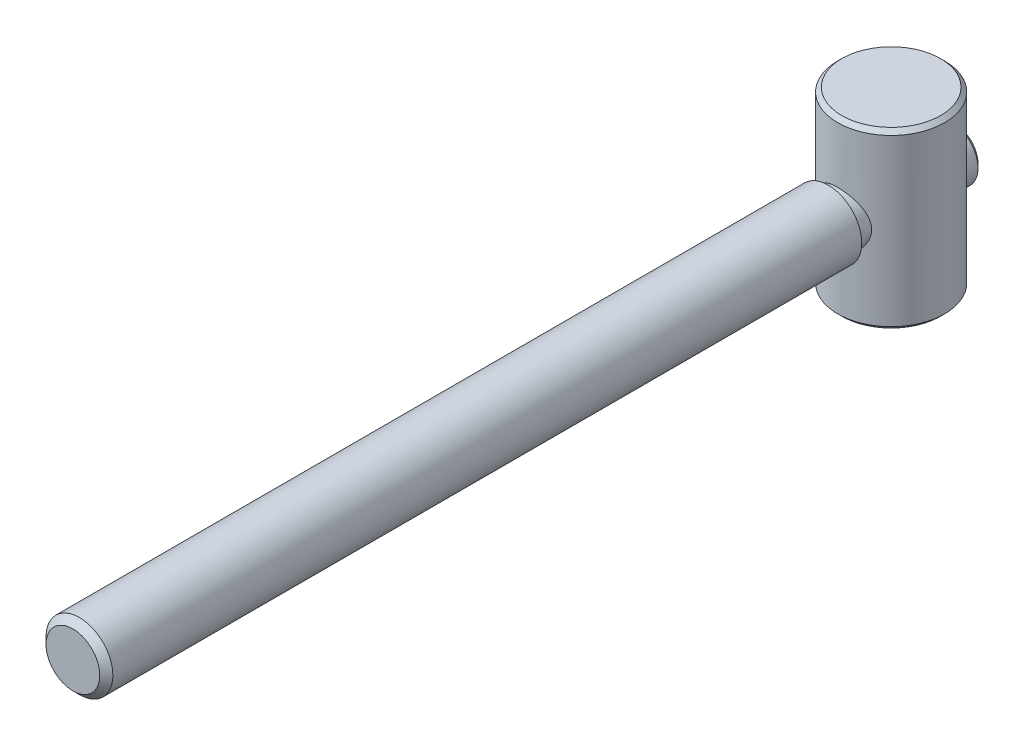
ISO-10303-21;
HEADER;
FILE_DESCRIPTION(('STEP AP214'),'2;1');
FILE_NAME('part.step','',(''),(''),'','','');
FILE_SCHEMA(('AUTOMOTIVE_DESIGN { 1 0 10303 214 1 1 1 1 }'));
ENDSEC;
DATA;
#1=APPLICATION_CONTEXT('core data for automotive mechanical design processes');
#2=APPLICATION_PROTOCOL_DEFINITION('international standard','automotive_design',2000,#1);
#3=PRODUCT_CONTEXT('',#1,'mechanical');
#4=PRODUCT('Part','Part','',(#3));
#5=PRODUCT_RELATED_PRODUCT_CATEGORY('part','',(#4));
#6=PRODUCT_DEFINITION_FORMATION('','',#4);
#7=PRODUCT_DEFINITION_CONTEXT('part definition',#1,'design');
#8=PRODUCT_DEFINITION('design','',#6,#7);
#9=PRODUCT_DEFINITION_SHAPE('','',#8);
#10=(LENGTH_UNIT() NAMED_UNIT(*) SI_UNIT(.MILLI.,.METRE.));
#11=(NAMED_UNIT(*) PLANE_ANGLE_UNIT() SI_UNIT($,.RADIAN.));
#12=(NAMED_UNIT(*) SI_UNIT($,.STERADIAN.) SOLID_ANGLE_UNIT());
#13=UNCERTAINTY_MEASURE_WITH_UNIT(LENGTH_MEASURE(1.E-05),#10,'distance_accuracy_value','');
#14=(GEOMETRIC_REPRESENTATION_CONTEXT(3) GLOBAL_UNCERTAINTY_ASSIGNED_CONTEXT((#13)) GLOBAL_UNIT_ASSIGNED_CONTEXT((#10,
#11,#12)) REPRESENTATION_CONTEXT('',''));
#15=CARTESIAN_POINT('',(0.,0.,0.));
#16=DIRECTION('',(0.,0.,1.));
#17=DIRECTION('',(1.,0.,0.));
#18=AXIS2_PLACEMENT_3D('',#15,#16,#17);
#19=CARTESIAN_POINT('',(-0.4,0.,-46.2));
#20=DIRECTION('',(1.,0.,0.));
#21=DIRECTION('',(0.,-1.,0.));
#22=AXIS2_PLACEMENT_3D('',#19,#20,#21);
#23=CYLINDRICAL_SURFACE('',#22,31.5);
#24=CARTESIAN_POINT('',(-0.4,0.,-46.2));
#25=DIRECTION('',(-1.,0.,0.));
#26=DIRECTION('',(0.,1.,0.));
#27=AXIS2_PLACEMENT_3D('',#24,#25,#26);
#28=CIRCLE('',#27,31.5);
#29=CARTESIAN_POINT('',(-0.4,-1.95959179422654,-14.7610114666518));
#30=VERTEX_POINT('',#29);
#31=CARTESIAN_POINT('',(-0.4,1.95959179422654,-14.7610114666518));
#32=VERTEX_POINT('',#31);
#33=EDGE_CURVE('E118',#30,#32,#28,.T.);
#34=ORIENTED_EDGE('',*,*,#33,.T.);
#35=CARTESIAN_POINT('',(-0.4,1.95959179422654,-14.7610114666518));
#36=CARTESIAN_POINT('',(-0.344561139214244,1.97091486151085,-14.7617184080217));
#37=CARTESIAN_POINT('',(-0.28863792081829,1.97987306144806,-14.762281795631));
#38=CARTESIAN_POINT('',(-0.176213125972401,1.99302430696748,-14.7631121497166));
#39=CARTESIAN_POINT('',(-0.119711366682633,1.99721579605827,-14.7633790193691));
#40=CARTESIAN_POINT('',(-0.00749894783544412,2.0007609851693,-14.7636046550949));
#41=CARTESIAN_POINT('',(0.0482092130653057,2.00019410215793,-14.7635684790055));
#42=CARTESIAN_POINT('',(0.159360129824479,1.99441663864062,-14.7632012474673));
#43=CARTESIAN_POINT('',(0.214802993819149,1.98920814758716,-14.7628703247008));
#44=CARTESIAN_POINT('',(0.313516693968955,1.97576492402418,-14.762023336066));
#45=CARTESIAN_POINT('',(0.356906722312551,1.96839158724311,-14.761560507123));
#46=CARTESIAN_POINT('',(0.4,1.95959179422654,-14.7610114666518));
#47=B_SPLINE_CURVE_WITH_KNOTS('',3,(#35,#36,#37,#38,#39,#40,#41,#42,#43,#44,#45,#46),
.UNSPECIFIED.,.F.,.F.,(4,2,2,2,2,4),(0.,0.169712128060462,0.33947965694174,0.506419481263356,
0.673284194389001,0.805229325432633),.UNSPECIFIED.);
#48=CARTESIAN_POINT('',(0.4,1.95959179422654,-14.7610114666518));
#49=VERTEX_POINT('',#48);
#50=EDGE_CURVE('E208',#32,#49,#47,.T.);
#51=ORIENTED_EDGE('',*,*,#50,.T.);
#52=CARTESIAN_POINT('',(0.4,0.,-46.2));
#53=DIRECTION('',(-1.,0.,0.));
#54=DIRECTION('',(0.,1.,0.));
#55=AXIS2_PLACEMENT_3D('',#52,#53,#54);
#56=CIRCLE('',#55,31.5);
#57=CARTESIAN_POINT('',(0.4,-1.95959179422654,-14.7610114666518));
#58=VERTEX_POINT('',#57);
#59=EDGE_CURVE('E105',#58,#49,#56,.T.);
#60=ORIENTED_EDGE('',*,*,#59,.F.);
#61=CARTESIAN_POINT('',(0.4,-1.95959179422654,-14.7610114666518));
#62=CARTESIAN_POINT('',(0.344561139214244,-1.97091486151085,-14.7617184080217));
#63=CARTESIAN_POINT('',(0.28863792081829,-1.97987306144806,-14.762281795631));
#64=CARTESIAN_POINT('',(0.176213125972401,-1.99302430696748,-14.7631121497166));
#65=CARTESIAN_POINT('',(0.119711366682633,-1.99721579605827,-14.7633790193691));
#66=CARTESIAN_POINT('',(0.00749894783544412,-2.0007609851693,-14.7636046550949));
#67=CARTESIAN_POINT('',(-0.0482092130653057,-2.00019410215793,-14.7635684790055));
#68=CARTESIAN_POINT('',(-0.159360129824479,-1.99441663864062,-14.7632012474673));
#69=CARTESIAN_POINT('',(-0.214802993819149,-1.98920814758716,-14.7628703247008));
#70=CARTESIAN_POINT('',(-0.313516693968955,-1.97576492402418,-14.762023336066));
#71=CARTESIAN_POINT('',(-0.356906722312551,-1.96839158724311,-14.761560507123));
#72=CARTESIAN_POINT('',(-0.4,-1.95959179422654,-14.7610114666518));
#73=B_SPLINE_CURVE_WITH_KNOTS('',3,(#61,#62,#63,#64,#65,#66,#67,#68,#69,#70,#71,#72),
.UNSPECIFIED.,.F.,.F.,(4,2,2,2,2,4),(0.,0.169712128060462,0.33947965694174,0.506419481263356,
0.673284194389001,0.805229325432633),.UNSPECIFIED.);
#74=EDGE_CURVE('E120',#58,#30,#73,.T.);
#75=ORIENTED_EDGE('',*,*,#74,.T.);
#76=EDGE_LOOP('',(#34,#51,#60,#75));
#77=FACE_BOUND('',#76,.T.);
#78=ADVANCED_FACE('F19',(#77),#23,.F.);
#79=CARTESIAN_POINT('',(0.,0.,-6.7));
#80=DIRECTION('',(0.,0.,1.));
#81=DIRECTION('',(1.,0.,0.));
#82=AXIS2_PLACEMENT_3D('',#79,#80,#81);
#83=CYLINDRICAL_SURFACE('',#82,2.);
#84=DIRECTION('',(0.,0.,1.));
#85=VECTOR('',#84,1.);
#86=CARTESIAN_POINT('',(0.4,-1.95959179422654,-16.2));
#87=LINE('',#86,#85);
#88=CARTESIAN_POINT('',(0.4,-1.95959179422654,-15.8935));
#89=VERTEX_POINT('',#88);
#90=CARTESIAN_POINT('',(0.4,-1.95959179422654,-15.3799497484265));
#91=VERTEX_POINT('',#90);
#92=EDGE_CURVE('E315',#89,#91,#87,.T.);
#93=ORIENTED_EDGE('',*,*,#92,.F.);
#94=CARTESIAN_POINT('',(0.,0.,-15.8935));
#95=DIRECTION('',(0.,0.,1.));
#96=DIRECTION('',(1.,0.,0.));
#97=AXIS2_PLACEMENT_3D('',#94,#95,#96);
#98=CIRCLE('',#97,2.);
#99=CARTESIAN_POINT('',(0.4,1.95959179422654,-15.8935));
#100=VERTEX_POINT('',#99);
#101=EDGE_CURVE('E589',#89,#100,#98,.T.);
#102=ORIENTED_EDGE('',*,*,#101,.T.);
#103=DIRECTION('',(0.,0.,1.));
#104=VECTOR('',#103,1.);
#105=CARTESIAN_POINT('',(0.4,1.95959179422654,-16.2));
#106=LINE('',#105,#104);
#107=CARTESIAN_POINT('',(0.4,1.95959179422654,-15.3799497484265));
#108=VERTEX_POINT('',#107);
#109=EDGE_CURVE('E313',#100,#108,#106,.T.);
#110=ORIENTED_EDGE('',*,*,#109,.T.);
#111=CARTESIAN_POINT('',(2.,0.,-14.8641016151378));
#112=CARTESIAN_POINT('',(1.99999158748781,0.104213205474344,-14.8641118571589));
#113=CARTESIAN_POINT('',(1.99179963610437,0.208562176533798,-14.8688763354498));
#114=CARTESIAN_POINT('',(1.95944672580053,0.414055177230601,-14.8872470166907));
#115=CARTESIAN_POINT('',(1.93525221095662,0.515192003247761,-14.9008717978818));
#116=CARTESIAN_POINT('',(1.8721998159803,0.710903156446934,-14.9349870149));
#117=CARTESIAN_POINT('',(1.83341988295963,0.80550925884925,-14.9554408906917));
#118=CARTESIAN_POINT('',(1.74253507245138,0.986848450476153,-15.0008532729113));
#119=CARTESIAN_POINT('',(1.69042947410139,1.07358111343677,-15.0258120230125));
#120=CARTESIAN_POINT('',(1.569333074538,1.24461144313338,-15.0799373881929));
#121=CARTESIAN_POINT('',(1.49930407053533,1.32811826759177,-15.109281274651));
#122=CARTESIAN_POINT('',(1.34650761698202,1.4828167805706,-15.1674396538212));
#123=CARTESIAN_POINT('',(1.26373385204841,1.55400232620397,-15.1962538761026));
#124=CARTESIAN_POINT('',(1.08097912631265,1.6867343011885,-15.2524295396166));
#125=CARTESIAN_POINT('',(0.980214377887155,1.74730753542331,-15.2795621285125));
#126=CARTESIAN_POINT('',(0.768314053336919,1.85028170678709,-15.3270151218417));
#127=CARTESIAN_POINT('',(0.657185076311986,1.8926941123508,-15.3473398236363));
#128=CARTESIAN_POINT('',(0.436089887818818,1.95500932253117,-15.3776092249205));
#129=CARTESIAN_POINT('',(0.326603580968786,1.9762990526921,-15.3881896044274));
#130=CARTESIAN_POINT('',(0.105141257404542,2.00033223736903,-15.4001516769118));
#131=CARTESIAN_POINT('',(-0.00683321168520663,2.00308691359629,-15.4015389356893));
#132=CARTESIAN_POINT('',(-0.219665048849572,1.99050665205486,-15.3952596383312));
#133=CARTESIAN_POINT('',(-0.320642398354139,1.97672396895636,-15.3883699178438));
#134=CARTESIAN_POINT('',(-0.518627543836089,1.93423831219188,-15.3674849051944));
#135=CARTESIAN_POINT('',(-0.615635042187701,1.90553422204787,-15.3534890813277));
#136=CARTESIAN_POINT('',(-0.804618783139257,1.83383486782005,-15.3194316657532));
#137=CARTESIAN_POINT('',(-0.896506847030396,1.79064737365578,-15.299288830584));
#138=CARTESIAN_POINT('',(-1.07195360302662,1.6914731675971,-15.2547529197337));
#139=CARTESIAN_POINT('',(-1.15550929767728,1.63548187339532,-15.2303583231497));
#140=CARTESIAN_POINT('',(-1.3203473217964,1.50620929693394,-15.1768878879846));
#141=CARTESIAN_POINT('',(-1.40066815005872,1.43179394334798,-15.1475875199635));
#142=CARTESIAN_POINT('',(-1.54820874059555,1.27082055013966,-15.0890868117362));
#143=CARTESIAN_POINT('',(-1.61541842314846,1.18425325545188,-15.0598865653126));
#144=CARTESIAN_POINT('',(-1.73901066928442,0.994703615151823,-15.0028831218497));
#145=CARTESIAN_POINT('',(-1.7944346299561,0.89102795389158,-14.9752863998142));
#146=CARTESIAN_POINT('',(-1.88663822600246,0.674124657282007,-14.9275090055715));
#147=CARTESIAN_POINT('',(-1.92343731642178,0.560907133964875,-14.9073206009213));
#148=CARTESIAN_POINT('',(-1.97436042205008,0.337570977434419,-14.8788927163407));
#149=CARTESIAN_POINT('',(-1.99005024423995,0.227917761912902,-14.8698331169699));
#150=CARTESIAN_POINT('',(-2.00303389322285,0.00719731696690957,-14.8623583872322));
#151=CARTESIAN_POINT('',(-2.00034071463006,-0.103868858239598,-14.8639357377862));
#152=CARTESIAN_POINT('',(-1.97807208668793,-0.311307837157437,-14.8766867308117));
#153=CARTESIAN_POINT('',(-1.96037563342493,-0.407958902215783,-14.8867917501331));
#154=CARTESIAN_POINT('',(-1.91139256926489,-0.596735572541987,-14.9138804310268));
#155=CARTESIAN_POINT('',(-1.88010155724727,-0.688859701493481,-14.9308663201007));
#156=CARTESIAN_POINT('',(-1.80329517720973,-0.870822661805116,-14.9707244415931));
#157=CARTESIAN_POINT('',(-1.7571881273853,-0.960358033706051,-14.9938328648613));
#158=CARTESIAN_POINT('',(-1.65257412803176,-1.13093854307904,-15.043122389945));
#159=CARTESIAN_POINT('',(-1.59406080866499,-1.21197928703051,-15.069305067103));
#160=CARTESIAN_POINT('',(-1.45767433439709,-1.37395753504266,-15.1257599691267));
#161=CARTESIAN_POINT('',(-1.37829054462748,-1.45359430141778,-15.1561316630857));
#162=CARTESIAN_POINT('',(-1.20680899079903,-1.59882447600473,-15.214684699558));
#163=CARTESIAN_POINT('',(-1.11470694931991,-1.66441314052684,-15.2428653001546));
#164=CARTESIAN_POINT('',(-0.917070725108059,-1.78114745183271,-15.2948272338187));
#165=CARTESIAN_POINT('',(-0.811246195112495,-1.83186623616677,-15.3184728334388));
#166=CARTESIAN_POINT('',(-0.591044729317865,-1.91427580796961,-15.3576670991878));
#167=CARTESIAN_POINT('',(-0.476675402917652,-1.9459833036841,-15.373222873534));
#168=CARTESIAN_POINT('',(-0.253959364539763,-1.98673712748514,-15.3933501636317));
#169=CARTESIAN_POINT('',(-0.1460228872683,-1.99759574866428,-15.3987985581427));
#170=CARTESIAN_POINT('',(0.0702519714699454,-2.00168653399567,-15.4008426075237));
#171=CARTESIAN_POINT('',(0.178590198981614,-1.99492486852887,-15.3974413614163));
#172=CARTESIAN_POINT('',(0.385075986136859,-1.96516717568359,-15.3826793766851));
#173=CARTESIAN_POINT('',(0.483424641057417,-1.94327026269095,-15.3718578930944));
#174=CARTESIAN_POINT('',(0.674891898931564,-1.88534604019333,-15.3438418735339));
#175=CARTESIAN_POINT('',(0.768009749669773,-1.84931670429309,-15.3266464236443));
#176=CARTESIAN_POINT('',(0.95084683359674,-1.7625457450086,-15.2865186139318));
#177=CARTESIAN_POINT('',(1.04025036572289,-1.71124078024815,-15.263372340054));
#178=CARTESIAN_POINT('',(1.20954920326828,-1.59608471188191,-15.2137626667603));
#179=CARTESIAN_POINT('',(1.28944011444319,-1.53222784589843,-15.1872977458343));
#180=CARTESIAN_POINT('',(1.44582833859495,-1.38640336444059,-15.1305721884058));
#181=CARTESIAN_POINT('',(1.52119665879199,-1.30326581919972,-15.1001959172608));
#182=CARTESIAN_POINT('',(1.65732528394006,-1.12510777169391,-15.0412615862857));
#183=CARTESIAN_POINT('',(1.71807266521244,-1.03007686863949,-15.0127051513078));
#184=CARTESIAN_POINT('',(1.82486714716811,-0.826691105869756,-14.9599918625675));
#185=CARTESIAN_POINT('',(1.87038902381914,-0.718010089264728,-14.9360025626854));
#186=CARTESIAN_POINT('',(1.92395929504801,-0.549421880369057,-14.9069621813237));
#187=CARTESIAN_POINT('',(1.93935666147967,-0.492352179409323,-14.898443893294));
#188=CARTESIAN_POINT('',(1.96508069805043,-0.376767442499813,-14.8840605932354));
#189=CARTESIAN_POINT('',(1.97541091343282,-0.318253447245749,-14.8781937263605));
#190=CARTESIAN_POINT('',(1.9887293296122,-0.21639921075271,-14.8705902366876));
#191=CARTESIAN_POINT('',(1.99295091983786,-0.173266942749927,-14.8681638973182));
#192=CARTESIAN_POINT('',(1.99858810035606,-0.0867643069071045,-14.8649174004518));
#193=CARTESIAN_POINT('',(2.00000350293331,-0.0433939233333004,-14.8640973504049));
#194=CARTESIAN_POINT('',(2.,0.,-14.8641016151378));
#195=B_SPLINE_CURVE_WITH_KNOTS('',3,(#111,#112,#113,#114,#115,#116,#117,#118,#119,#120,#121,
#122,#123,#124,#125,#126,#127,#128,#129,#130,#131,#132,#133,#134,#135,#136,#137,#138,#139,#140,
#141,#142,#143,#144,#145,#146,#147,#148,#149,#150,#151,#152,#153,#154,#155,#156,#157,#158,#159,
#160,#161,#162,#163,#164,#165,#166,#167,#168,#169,#170,#171,#172,#173,#174,#175,#176,#177,#178,
#179,#180,#181,#182,#183,#184,#185,#186,#187,#188,#189,#190,#191,#192,#193,#194),.UNSPECIFIED.,
.T.,.F.,(4,2,2,2,2,2,2,2,2,2,2,2,2,2,2,2,2,2,2,2,2,2,2,2,2,2,2,2,2,2,2,2,2,2,2,2,2,2,2,2,2,4),
(0.,0.312464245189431,0.625585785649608,0.937057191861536,1.24854545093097,1.58572462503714,
1.92307142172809,2.28315784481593,2.64301653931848,2.97726969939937,3.31132047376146,
3.61632194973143,3.92134625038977,4.2305906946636,4.5399459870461,4.87854382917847,
5.21740096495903,5.57777683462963,5.93777548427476,6.2692458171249,6.60048186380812,
6.89548366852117,7.19058104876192,7.49934592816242,7.80826972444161,8.15613487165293,
8.50411729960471,8.86128362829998,9.21813559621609,9.5422454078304,9.8662417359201,
10.1688884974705,10.4715786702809,10.7872150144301,11.102996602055,11.450204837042,
11.7977188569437,12.1562149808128,12.3351395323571,12.5139387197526,12.6440387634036,
12.7741475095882),.UNSPECIFIED.);
#196=EDGE_CURVE('E113',#91,#108,#195,.T.);
#197=ORIENTED_EDGE('',*,*,#196,.F.);
#198=EDGE_LOOP('',(#93,#102,#110,#197));
#199=FACE_BOUND('',#198,.T.);
#200=ADVANCED_FACE('F222',(#199),#83,.T.);
#201=CARTESIAN_POINT('',(0.4,0.,-46.2));
#202=DIRECTION('',(-1.,0.,0.));
#203=DIRECTION('',(0.,1.,0.));
#204=AXIS2_PLACEMENT_3D('',#201,#202,#203);
#205=PLANE('',#204);
#206=DIRECTION('',(0.,1.,0.));
#207=VECTOR('',#206,1.);
#208=CARTESIAN_POINT('',(0.4,1.95959179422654,-16.2));
#209=LINE('',#208,#207);
#210=CARTESIAN_POINT('',(0.4,-1.64558264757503,-16.2));
#211=VERTEX_POINT('',#210);
#212=CARTESIAN_POINT('',(0.4,1.64558264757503,-16.2));
#213=VERTEX_POINT('',#212);
#214=EDGE_CURVE('E309',#211,#213,#209,.T.);
#215=ORIENTED_EDGE('',*,*,#214,.F.);
#216=CARTESIAN_POINT('',(0.4,-1.64558264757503,-16.2));
#217=CARTESIAN_POINT('',(0.4,-1.69802260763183,-16.149024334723));
#218=CARTESIAN_POINT('',(0.4,-1.75041001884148,-16.0979948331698));
#219=CARTESIAN_POINT('',(0.4,-1.85507973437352,-15.9958281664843));
#220=CARTESIAN_POINT('',(0.4,-1.90736203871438,-15.9446910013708));
#221=CARTESIAN_POINT('',(0.4,-1.95959179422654,-15.8935));
#222=B_SPLINE_CURVE_WITH_KNOTS('',3,(#216,#217,#218,#219,#220,#221),.UNSPECIFIED.,.F.,.F.,(4,2,
4),(0.,0.219399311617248,0.438798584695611),.UNSPECIFIED.);
#223=EDGE_CURVE('E249',#211,#89,#222,.T.);
#224=ORIENTED_EDGE('',*,*,#223,.T.);
#225=ORIENTED_EDGE('',*,*,#92,.T.);
#226=DIRECTION('',(0.,0.,1.));
#227=VECTOR('',#226,1.);
#228=CARTESIAN_POINT('',(0.4,-1.95959179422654,-6.7));
#229=LINE('',#228,#227);
#230=EDGE_CURVE('E101',#91,#58,#229,.T.);
#231=ORIENTED_EDGE('',*,*,#230,.T.);
#232=ORIENTED_EDGE('',*,*,#59,.T.);
#233=DIRECTION('',(0.,0.,1.));
#234=VECTOR('',#233,1.);
#235=CARTESIAN_POINT('',(0.4,1.95959179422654,-6.7));
#236=LINE('',#235,#234);
#237=EDGE_CURVE('E197',#49,#108,#236,.F.);
#238=ORIENTED_EDGE('',*,*,#237,.T.);
#239=ORIENTED_EDGE('',*,*,#109,.F.);
#240=CARTESIAN_POINT('',(0.4,1.95959179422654,-15.8935));
#241=CARTESIAN_POINT('',(0.4,1.90736203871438,-15.9446910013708));
#242=CARTESIAN_POINT('',(0.4,1.85507973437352,-15.9958281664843));
#243=CARTESIAN_POINT('',(0.4,1.75041001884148,-16.0979948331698));
#244=CARTESIAN_POINT('',(0.4,1.69802260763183,-16.149024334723));
#245=CARTESIAN_POINT('',(0.4,1.64558264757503,-16.2));
#246=B_SPLINE_CURVE_WITH_KNOTS('',3,(#240,#241,#242,#243,#244,#245),.UNSPECIFIED.,.F.,.F.,(4,2,
4),(0.,0.219399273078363,0.438798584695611),.UNSPECIFIED.);
#247=EDGE_CURVE('E242',#100,#213,#246,.T.);
#248=ORIENTED_EDGE('',*,*,#247,.T.);
#249=EDGE_LOOP('',(#215,#224,#225,#231,#232,#238,#239,#248));
#250=FACE_BOUND('',#249,.T.);
#251=ADVANCED_FACE('F224',(#250),#205,.T.);
#252=DIRECTION('',(0.,0.,1.));
#253=VECTOR('',#252,1.);
#254=CARTESIAN_POINT('',(-0.4,1.95959179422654,-16.2));
#255=LINE('',#254,#253);
#256=CARTESIAN_POINT('',(-0.4,1.95959179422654,-15.8935));
#257=VERTEX_POINT('',#256);
#258=CARTESIAN_POINT('',(-0.4,1.95959179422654,-15.3799497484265));
#259=VERTEX_POINT('',#258);
#260=EDGE_CURVE('E89',#257,#259,#255,.T.);
#261=ORIENTED_EDGE('',*,*,#260,.F.);
#262=CARTESIAN_POINT('',(0.,0.,-15.8935));
#263=DIRECTION('',(0.,0.,1.));
#264=DIRECTION('',(1.,0.,0.));
#265=AXIS2_PLACEMENT_3D('',#262,#263,#264);
#266=CIRCLE('',#265,2.);
#267=CARTESIAN_POINT('',(-0.4,-1.95959179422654,-15.8935));
#268=VERTEX_POINT('',#267);
#269=EDGE_CURVE('E11',#257,#268,#266,.T.);
#270=ORIENTED_EDGE('',*,*,#269,.T.);
#271=DIRECTION('',(0.,0.,1.));
#272=VECTOR('',#271,1.);
#273=CARTESIAN_POINT('',(-0.4,-1.95959179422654,-16.2));
#274=LINE('',#273,#272);
#275=CARTESIAN_POINT('',(-0.4,-1.95959179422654,-15.3799497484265));
#276=VERTEX_POINT('',#275);
#277=EDGE_CURVE('E81',#268,#276,#274,.T.);
#278=ORIENTED_EDGE('',*,*,#277,.T.);
#279=EDGE_CURVE('E85',#259,#276,#195,.T.);
#280=ORIENTED_EDGE('',*,*,#279,.F.);
#281=EDGE_LOOP('',(#261,#270,#278,#280));
#282=FACE_BOUND('',#281,.T.);
#283=ADVANCED_FACE('F83',(#282),#83,.T.);
#284=CARTESIAN_POINT('',(-0.4,0.,-46.2));
#285=DIRECTION('',(-1.,0.,0.));
#286=DIRECTION('',(0.,1.,0.));
#287=AXIS2_PLACEMENT_3D('',#284,#285,#286);
#288=PLANE('',#287);
#289=DIRECTION('',(0.,-1.,0.));
#290=VECTOR('',#289,1.);
#291=CARTESIAN_POINT('',(-0.4,-1.95959179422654,-16.2));
#292=LINE('',#291,#290);
#293=CARTESIAN_POINT('',(-0.4,1.64558264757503,-16.2));
#294=VERTEX_POINT('',#293);
#295=CARTESIAN_POINT('',(-0.4,-1.64558264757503,-16.2));
#296=VERTEX_POINT('',#295);
#297=EDGE_CURVE('E90',#294,#296,#292,.T.);
#298=ORIENTED_EDGE('',*,*,#297,.F.);
#299=CARTESIAN_POINT('',(-0.4,1.64558264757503,-16.2));
#300=CARTESIAN_POINT('',(-0.4,1.69802260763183,-16.149024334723));
#301=CARTESIAN_POINT('',(-0.4,1.75041001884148,-16.0979948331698));
#302=CARTESIAN_POINT('',(-0.4,1.85507973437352,-15.9958281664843));
#303=CARTESIAN_POINT('',(-0.4,1.90736203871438,-15.9446910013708));
#304=CARTESIAN_POINT('',(-0.4,1.95959179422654,-15.8935));
#305=B_SPLINE_CURVE_WITH_KNOTS('',3,(#299,#300,#301,#302,#303,#304),.UNSPECIFIED.,.F.,.F.,(4,2,
4),(0.,0.219399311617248,0.438798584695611),.UNSPECIFIED.);
#306=EDGE_CURVE('E29',#294,#257,#305,.T.);
#307=ORIENTED_EDGE('',*,*,#306,.T.);
#308=ORIENTED_EDGE('',*,*,#260,.T.);
#309=DIRECTION('',(0.,0.,1.));
#310=VECTOR('',#309,1.);
#311=CARTESIAN_POINT('',(-0.4,1.95959179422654,-6.7));
#312=LINE('',#311,#310);
#313=EDGE_CURVE('E164',#32,#259,#312,.F.);
#314=ORIENTED_EDGE('',*,*,#313,.F.);
#315=ORIENTED_EDGE('',*,*,#33,.F.);
#316=DIRECTION('',(0.,0.,1.));
#317=VECTOR('',#316,1.);
#318=CARTESIAN_POINT('',(-0.4,-1.95959179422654,-6.7));
#319=LINE('',#318,#317);
#320=EDGE_CURVE('E99',#276,#30,#319,.T.);
#321=ORIENTED_EDGE('',*,*,#320,.F.);
#322=ORIENTED_EDGE('',*,*,#277,.F.);
#323=CARTESIAN_POINT('',(-0.4,-1.95959179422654,-15.8935));
#324=CARTESIAN_POINT('',(-0.4,-1.90736203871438,-15.9446910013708));
#325=CARTESIAN_POINT('',(-0.4,-1.85507973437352,-15.9958281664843));
#326=CARTESIAN_POINT('',(-0.4,-1.75041001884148,-16.0979948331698));
#327=CARTESIAN_POINT('',(-0.4,-1.69802260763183,-16.149024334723));
#328=CARTESIAN_POINT('',(-0.4,-1.64558264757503,-16.2));
#329=B_SPLINE_CURVE_WITH_KNOTS('',3,(#323,#324,#325,#326,#327,#328),.UNSPECIFIED.,.F.,.F.,(4,2,
4),(0.,0.219399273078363,0.438798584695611),.UNSPECIFIED.);
#330=EDGE_CURVE('E576',#268,#296,#329,.T.);
#331=ORIENTED_EDGE('',*,*,#330,.T.);
#332=EDGE_LOOP('',(#298,#307,#308,#314,#315,#321,#322,#331));
#333=FACE_BOUND('',#332,.T.);
#334=ADVANCED_FACE('F115',(#333),#288,.F.);
#335=CARTESIAN_POINT('',(0.,-6.5,-11.4));
#336=DIRECTION('',(0.,-1.,0.));
#337=DIRECTION('',(-1.,0.,0.));
#338=AXIS2_PLACEMENT_3D('',#335,#336,#337);
#339=PLANE('',#338);
#340=CARTESIAN_POINT('',(0.,-6.5,-11.4));
#341=DIRECTION('',(0.,-1.,0.));
#342=DIRECTION('',(0.,0.,-1.));
#343=AXIS2_PLACEMENT_3D('',#340,#341,#342);
#344=CIRCLE('',#343,3.6935);
#345=CARTESIAN_POINT('',(0.,-6.5,-15.0935));
#346=VERTEX_POINT('',#345);
#347=EDGE_CURVE('E294',#346,#346,#344,.T.);
#348=ORIENTED_EDGE('',*,*,#347,.T.);
#349=EDGE_LOOP('',(#348));
#350=FACE_BOUND('',#349,.T.);
#351=ADVANCED_FACE('F343',(#350),#339,.T.);
#352=CARTESIAN_POINT('',(0.,6.5,-11.4));
#353=DIRECTION('',(0.,1.,0.));
#354=DIRECTION('',(1.,0.,0.));
#355=AXIS2_PLACEMENT_3D('',#352,#353,#354);
#356=PLANE('',#355);
#357=CARTESIAN_POINT('',(0.,6.5,-11.4));
#358=DIRECTION('',(0.,1.,0.));
#359=DIRECTION('',(0.,0.,1.));
#360=AXIS2_PLACEMENT_3D('',#357,#358,#359);
#361=CIRCLE('',#360,3.6935);
#362=CARTESIAN_POINT('',(0.,6.5,-7.7065));
#363=VERTEX_POINT('',#362);
#364=EDGE_CURVE('E285',#363,#363,#361,.T.);
#365=ORIENTED_EDGE('',*,*,#364,.T.);
#366=EDGE_LOOP('',(#365));
#367=FACE_BOUND('',#366,.T.);
#368=ADVANCED_FACE('F341',(#367),#356,.T.);
#369=CARTESIAN_POINT('',(0.,6.5,-11.4));
#370=DIRECTION('',(0.,1.,0.));
#371=DIRECTION('',(1.,0.,0.));
#372=AXIS2_PLACEMENT_3D('',#369,#370,#371);
#373=CYLINDRICAL_SURFACE('',#372,4.);
#374=CARTESIAN_POINT('',(0.,-6.1935,-11.4));
#375=DIRECTION('',(0.,-1.,0.));
#376=DIRECTION('',(0.,0.,-1.));
#377=AXIS2_PLACEMENT_3D('',#374,#375,#376);
#378=CIRCLE('',#377,4.);
#379=CARTESIAN_POINT('',(0.,-6.1935,-15.4));
#380=VERTEX_POINT('',#379);
#381=EDGE_CURVE('E290',#380,#380,#378,.F.);
#382=ORIENTED_EDGE('',*,*,#381,.T.);
#383=EDGE_LOOP('',(#382));
#384=FACE_BOUND('',#383,.T.);
#385=CARTESIAN_POINT('',(0.,6.1935,-11.4));
#386=DIRECTION('',(0.,1.,0.));
#387=DIRECTION('',(0.,0.,1.));
#388=AXIS2_PLACEMENT_3D('',#385,#386,#387);
#389=CIRCLE('',#388,4.);
#390=CARTESIAN_POINT('',(0.,6.1935,-7.4));
#391=VERTEX_POINT('',#390);
#392=EDGE_CURVE('E288',#391,#391,#389,.F.);
#393=ORIENTED_EDGE('',*,*,#392,.T.);
#394=EDGE_LOOP('',(#393));
#395=FACE_BOUND('',#394,.T.);
#396=CARTESIAN_POINT('',(2.,0.,-7.93589838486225));
#397=CARTESIAN_POINT('',(1.99999158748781,-0.104213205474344,-7.93588814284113));
#398=CARTESIAN_POINT('',(1.99179963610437,-0.208562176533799,-7.93112366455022));
#399=CARTESIAN_POINT('',(1.95944672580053,-0.414055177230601,-7.91275298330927));
#400=CARTESIAN_POINT('',(1.93525221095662,-0.515192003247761,-7.89912820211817));
#401=CARTESIAN_POINT('',(1.8721998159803,-0.710903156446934,-7.86501298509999));
#402=CARTESIAN_POINT('',(1.83341988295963,-0.80550925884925,-7.84455910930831));
#403=CARTESIAN_POINT('',(1.74253507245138,-0.986848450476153,-7.79914672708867));
#404=CARTESIAN_POINT('',(1.69042947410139,-1.07358111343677,-7.77418797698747));
#405=CARTESIAN_POINT('',(1.569333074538,-1.24461144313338,-7.72006261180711));
#406=CARTESIAN_POINT('',(1.49930407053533,-1.32811826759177,-7.69071872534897));
#407=CARTESIAN_POINT('',(1.34650761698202,-1.4828167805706,-7.63256034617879));
#408=CARTESIAN_POINT('',(1.26373385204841,-1.55400232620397,-7.60374612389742));
#409=CARTESIAN_POINT('',(1.08097912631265,-1.6867343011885,-7.5475704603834));
#410=CARTESIAN_POINT('',(0.980214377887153,-1.74730753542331,-7.52043787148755));
#411=CARTESIAN_POINT('',(0.768314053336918,-1.85028170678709,-7.47298487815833));
#412=CARTESIAN_POINT('',(0.657185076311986,-1.8926941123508,-7.45266017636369));
#413=CARTESIAN_POINT('',(0.436089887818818,-1.95500932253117,-7.42239077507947));
#414=CARTESIAN_POINT('',(0.326603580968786,-1.9762990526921,-7.4118103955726));
#415=CARTESIAN_POINT('',(0.105141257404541,-2.00033223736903,-7.39984832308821));
#416=CARTESIAN_POINT('',(-0.00683321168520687,-2.00308691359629,-7.39846106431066));
#417=CARTESIAN_POINT('',(-0.219665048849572,-1.99050665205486,-7.40474036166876));
#418=CARTESIAN_POINT('',(-0.320642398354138,-1.97672396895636,-7.41163008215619));
#419=CARTESIAN_POINT('',(-0.518627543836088,-1.93423831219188,-7.43251509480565));
#420=CARTESIAN_POINT('',(-0.6156350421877,-1.90553422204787,-7.44651091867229));
#421=CARTESIAN_POINT('',(-0.804618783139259,-1.83383486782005,-7.48056833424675));
#422=CARTESIAN_POINT('',(-0.896506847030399,-1.79064737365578,-7.50071116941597));
#423=CARTESIAN_POINT('',(-1.07195360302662,-1.6914731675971,-7.5452470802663));
#424=CARTESIAN_POINT('',(-1.15550929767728,-1.63548187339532,-7.56964167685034));
#425=CARTESIAN_POINT('',(-1.3203473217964,-1.50620929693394,-7.62311211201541));
#426=CARTESIAN_POINT('',(-1.40066815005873,-1.43179394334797,-7.6524124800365));
#427=CARTESIAN_POINT('',(-1.54820874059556,-1.27082055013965,-7.71091318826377));
#428=CARTESIAN_POINT('',(-1.61541842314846,-1.18425325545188,-7.74011343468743));
#429=CARTESIAN_POINT('',(-1.73901066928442,-0.994703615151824,-7.79711687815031));
#430=CARTESIAN_POINT('',(-1.7944346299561,-0.891027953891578,-7.82471360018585));
#431=CARTESIAN_POINT('',(-1.88663822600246,-0.674124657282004,-7.87249099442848));
#432=CARTESIAN_POINT('',(-1.92343731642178,-0.560907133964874,-7.89267939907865));
#433=CARTESIAN_POINT('',(-1.97436042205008,-0.33757097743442,-7.92110728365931));
#434=CARTESIAN_POINT('',(-1.99005024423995,-0.227917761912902,-7.93016688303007));
#435=CARTESIAN_POINT('',(-2.00303389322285,-0.00719731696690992,-7.93764161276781));
#436=CARTESIAN_POINT('',(-2.00034071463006,0.103868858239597,-7.93606426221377));
#437=CARTESIAN_POINT('',(-1.97807208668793,0.311307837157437,-7.9233132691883));
#438=CARTESIAN_POINT('',(-1.96037563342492,0.407958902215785,-7.91320824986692));
#439=CARTESIAN_POINT('',(-1.91139256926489,0.596735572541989,-7.88611956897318));
#440=CARTESIAN_POINT('',(-1.88010155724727,0.688859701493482,-7.86913367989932));
#441=CARTESIAN_POINT('',(-1.80329517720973,0.870822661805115,-7.82927555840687));
#442=CARTESIAN_POINT('',(-1.7571881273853,0.960358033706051,-7.80616713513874));
#443=CARTESIAN_POINT('',(-1.65257412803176,1.13093854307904,-7.756877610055));
#444=CARTESIAN_POINT('',(-1.59406080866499,1.21197928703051,-7.73069493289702));
#445=CARTESIAN_POINT('',(-1.45767433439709,1.37395753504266,-7.67424003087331));
#446=CARTESIAN_POINT('',(-1.37829054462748,1.45359430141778,-7.64386833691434));
#447=CARTESIAN_POINT('',(-1.20680899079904,1.59882447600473,-7.58531530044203));
#448=CARTESIAN_POINT('',(-1.11470694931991,1.66441314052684,-7.55713469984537));
#449=CARTESIAN_POINT('',(-0.917070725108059,1.78114745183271,-7.50517276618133));
#450=CARTESIAN_POINT('',(-0.811246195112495,1.83186623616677,-7.48152716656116));
#451=CARTESIAN_POINT('',(-0.591044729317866,1.91427580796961,-7.44233290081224));
#452=CARTESIAN_POINT('',(-0.476675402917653,1.9459833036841,-7.42677712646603));
#453=CARTESIAN_POINT('',(-0.253959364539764,1.98673712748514,-7.40664983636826));
#454=CARTESIAN_POINT('',(-0.1460228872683,1.99759574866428,-7.4012014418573));
#455=CARTESIAN_POINT('',(0.0702519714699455,2.00168653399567,-7.39915739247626));
#456=CARTESIAN_POINT('',(0.178590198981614,1.99492486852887,-7.40255863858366));
#457=CARTESIAN_POINT('',(0.385075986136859,1.96516717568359,-7.41732062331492));
#458=CARTESIAN_POINT('',(0.483424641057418,1.94327026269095,-7.42814210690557));
#459=CARTESIAN_POINT('',(0.674891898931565,1.88534604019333,-7.45615812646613));
#460=CARTESIAN_POINT('',(0.768009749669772,1.84931670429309,-7.47335357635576));
#461=CARTESIAN_POINT('',(0.950846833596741,1.7625457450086,-7.51348138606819));
#462=CARTESIAN_POINT('',(1.0402503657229,1.71124078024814,-7.53662765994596));
#463=CARTESIAN_POINT('',(1.20954920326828,1.59608471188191,-7.58623733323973));
#464=CARTESIAN_POINT('',(1.28944011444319,1.53222784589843,-7.61270225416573));
#465=CARTESIAN_POINT('',(1.44582833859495,1.38640336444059,-7.66942781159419));
#466=CARTESIAN_POINT('',(1.52119665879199,1.30326581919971,-7.69980408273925));
#467=CARTESIAN_POINT('',(1.65732528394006,1.12510777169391,-7.75873841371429));
#468=CARTESIAN_POINT('',(1.71807266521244,1.03007686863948,-7.78729484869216));
#469=CARTESIAN_POINT('',(1.82486714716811,0.826691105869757,-7.84000813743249));
#470=CARTESIAN_POINT('',(1.87038902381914,0.718010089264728,-7.86399743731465));
#471=CARTESIAN_POINT('',(1.92395929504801,0.549421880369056,-7.8930378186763));
#472=CARTESIAN_POINT('',(1.93935666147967,0.492352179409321,-7.90155610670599));
#473=CARTESIAN_POINT('',(1.96508069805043,0.376767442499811,-7.91593940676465));
#474=CARTESIAN_POINT('',(1.97541091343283,0.318253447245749,-7.9218062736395));
#475=CARTESIAN_POINT('',(1.9887293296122,0.21639921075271,-7.92940976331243));
#476=CARTESIAN_POINT('',(1.99295091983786,0.173266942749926,-7.93183610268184));
#477=CARTESIAN_POINT('',(1.99858810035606,0.086764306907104,-7.93508259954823));
#478=CARTESIAN_POINT('',(2.00000350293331,0.0433939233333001,-7.93590264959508));
#479=CARTESIAN_POINT('',(2.,0.,-7.93589838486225));
#480=B_SPLINE_CURVE_WITH_KNOTS('',3,(#396,#397,#398,#399,#400,#401,#402,#403,#404,#405,#406,
#407,#408,#409,#410,#411,#412,#413,#414,#415,#416,#417,#418,#419,#420,#421,#422,#423,#424,#425,
#426,#427,#428,#429,#430,#431,#432,#433,#434,#435,#436,#437,#438,#439,#440,#441,#442,#443,#444,
#445,#446,#447,#448,#449,#450,#451,#452,#453,#454,#455,#456,#457,#458,#459,#460,#461,#462,#463,
#464,#465,#466,#467,#468,#469,#470,#471,#472,#473,#474,#475,#476,#477,#478,#479),.UNSPECIFIED.,
.T.,.F.,(4,2,2,2,2,2,2,2,2,2,2,2,2,2,2,2,2,2,2,2,2,2,2,2,2,2,2,2,2,2,2,2,2,2,2,2,2,2,2,2,2,4),
(0.,0.312464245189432,0.62558578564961,0.937057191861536,1.24854545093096,1.58572462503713,
1.92307142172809,2.28315784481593,2.64301653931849,2.97726969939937,3.31132047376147,
3.61632194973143,3.92134625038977,4.2305906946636,4.53994598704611,4.87854382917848,
5.21740096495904,5.57777683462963,5.93777548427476,6.2692458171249,6.60048186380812,
6.89548366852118,7.19058104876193,7.49934592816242,7.80826972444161,8.15613487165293,
8.50411729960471,8.86128362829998,9.2181355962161,9.5422454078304,9.8662417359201,
10.1688884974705,10.4715786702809,10.7872150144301,11.102996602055,11.450204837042,
11.7977188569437,12.1562149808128,12.3351395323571,12.5139387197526,12.6440387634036,
12.7741475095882),.UNSPECIFIED.);
#481=CARTESIAN_POINT('',(2.,0.,-7.93589838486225));
#482=VERTEX_POINT('',#481);
#483=EDGE_CURVE('E112',#482,#482,#480,.T.);
#484=ORIENTED_EDGE('',*,*,#483,.T.);
#485=EDGE_LOOP('',(#484));
#486=FACE_BOUND('',#485,.T.);
#487=CARTESIAN_POINT('',(-2.,0.,-14.8641016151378));
#488=CARTESIAN_POINT('',(-1.99999158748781,-0.104213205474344,-14.8641118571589));
#489=CARTESIAN_POINT('',(-1.99179963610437,-0.208562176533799,-14.8688763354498));
#490=CARTESIAN_POINT('',(-1.95944672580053,-0.414055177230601,-14.8872470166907));
#491=CARTESIAN_POINT('',(-1.93525221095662,-0.515192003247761,-14.9008717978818));
#492=CARTESIAN_POINT('',(-1.8721998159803,-0.710903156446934,-14.9349870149));
#493=CARTESIAN_POINT('',(-1.83341988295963,-0.80550925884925,-14.9554408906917));
#494=CARTESIAN_POINT('',(-1.74253507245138,-0.986848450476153,-15.0008532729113));
#495=CARTESIAN_POINT('',(-1.69042947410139,-1.07358111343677,-15.0258120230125));
#496=CARTESIAN_POINT('',(-1.569333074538,-1.24461144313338,-15.0799373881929));
#497=CARTESIAN_POINT('',(-1.49930407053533,-1.32811826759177,-15.109281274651));
#498=CARTESIAN_POINT('',(-1.34650761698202,-1.4828167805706,-15.1674396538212));
#499=CARTESIAN_POINT('',(-1.26373385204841,-1.55400232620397,-15.1962538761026));
#500=CARTESIAN_POINT('',(-1.08097912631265,-1.6867343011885,-15.2524295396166));
#501=CARTESIAN_POINT('',(-0.980214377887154,-1.74730753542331,-15.2795621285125));
#502=CARTESIAN_POINT('',(-0.768314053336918,-1.85028170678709,-15.3270151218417));
#503=CARTESIAN_POINT('',(-0.657185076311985,-1.8926941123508,-15.3473398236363));
#504=CARTESIAN_POINT('',(-0.436089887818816,-1.95500932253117,-15.3776092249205));
#505=CARTESIAN_POINT('',(-0.326603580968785,-1.9762990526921,-15.3881896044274));
#506=CARTESIAN_POINT('',(-0.105141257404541,-2.00033223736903,-15.4001516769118));
#507=CARTESIAN_POINT('',(0.0068332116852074,-2.00308691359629,-15.4015389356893));
#508=CARTESIAN_POINT('',(0.219665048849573,-1.99050665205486,-15.3952596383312));
#509=CARTESIAN_POINT('',(0.32064239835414,-1.97672396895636,-15.3883699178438));
#510=CARTESIAN_POINT('',(0.51862754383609,-1.93423831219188,-15.3674849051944));
#511=CARTESIAN_POINT('',(0.615635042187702,-1.90553422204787,-15.3534890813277));
#512=CARTESIAN_POINT('',(0.804618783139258,-1.83383486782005,-15.3194316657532));
#513=CARTESIAN_POINT('',(0.896506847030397,-1.79064737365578,-15.299288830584));
#514=CARTESIAN_POINT('',(1.07195360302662,-1.6914731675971,-15.2547529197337));
#515=CARTESIAN_POINT('',(1.15550929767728,-1.63548187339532,-15.2303583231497));
#516=CARTESIAN_POINT('',(1.3203473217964,-1.50620929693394,-15.1768878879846));
#517=CARTESIAN_POINT('',(1.40066815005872,-1.43179394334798,-15.1475875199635));
#518=CARTESIAN_POINT('',(1.54820874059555,-1.27082055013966,-15.0890868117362));
#519=CARTESIAN_POINT('',(1.61541842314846,-1.18425325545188,-15.0598865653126));
#520=CARTESIAN_POINT('',(1.73901066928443,-0.994703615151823,-15.0028831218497));
#521=CARTESIAN_POINT('',(1.7944346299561,-0.89102795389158,-14.9752863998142));
#522=CARTESIAN_POINT('',(1.88663822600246,-0.674124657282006,-14.9275090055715));
#523=CARTESIAN_POINT('',(1.92343731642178,-0.560907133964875,-14.9073206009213));
#524=CARTESIAN_POINT('',(1.97436042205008,-0.337570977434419,-14.8788927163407));
#525=CARTESIAN_POINT('',(1.99005024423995,-0.227917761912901,-14.8698331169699));
#526=CARTESIAN_POINT('',(2.00303389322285,-0.00719731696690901,-14.8623583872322));
#527=CARTESIAN_POINT('',(2.00034071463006,0.103868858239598,-14.8639357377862));
#528=CARTESIAN_POINT('',(1.97807208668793,0.311307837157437,-14.8766867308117));
#529=CARTESIAN_POINT('',(1.96037563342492,0.407958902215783,-14.8867917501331));
#530=CARTESIAN_POINT('',(1.91139256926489,0.596735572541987,-14.9138804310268));
#531=CARTESIAN_POINT('',(1.88010155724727,0.688859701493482,-14.9308663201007));
#532=CARTESIAN_POINT('',(1.80329517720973,0.870822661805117,-14.9707244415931));
#533=CARTESIAN_POINT('',(1.7571881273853,0.960358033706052,-14.9938328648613));
#534=CARTESIAN_POINT('',(1.65257412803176,1.13093854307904,-15.043122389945));
#535=CARTESIAN_POINT('',(1.59406080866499,1.21197928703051,-15.069305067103));
#536=CARTESIAN_POINT('',(1.45767433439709,1.37395753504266,-15.1257599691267));
#537=CARTESIAN_POINT('',(1.37829054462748,1.45359430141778,-15.1561316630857));
#538=CARTESIAN_POINT('',(1.20680899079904,1.59882447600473,-15.214684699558));
#539=CARTESIAN_POINT('',(1.11470694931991,1.66441314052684,-15.2428653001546));
#540=CARTESIAN_POINT('',(0.917070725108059,1.78114745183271,-15.2948272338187));
#541=CARTESIAN_POINT('',(0.811246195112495,1.83186623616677,-15.3184728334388));
#542=CARTESIAN_POINT('',(0.591044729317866,1.91427580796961,-15.3576670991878));
#543=CARTESIAN_POINT('',(0.476675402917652,1.9459833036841,-15.373222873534));
#544=CARTESIAN_POINT('',(0.253959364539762,1.98673712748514,-15.3933501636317));
#545=CARTESIAN_POINT('',(0.146022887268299,1.99759574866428,-15.3987985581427));
#546=CARTESIAN_POINT('',(-0.0702519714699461,2.00168653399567,-15.4008426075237));
#547=CARTESIAN_POINT('',(-0.178590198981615,1.99492486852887,-15.3974413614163));
#548=CARTESIAN_POINT('',(-0.385075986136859,1.96516717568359,-15.3826793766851));
#549=CARTESIAN_POINT('',(-0.483424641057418,1.94327026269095,-15.3718578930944));
#550=CARTESIAN_POINT('',(-0.674891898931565,1.88534604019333,-15.3438418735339));
#551=CARTESIAN_POINT('',(-0.768009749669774,1.84931670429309,-15.3266464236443));
#552=CARTESIAN_POINT('',(-0.950846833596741,1.7625457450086,-15.2865186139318));
#553=CARTESIAN_POINT('',(-1.04025036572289,1.71124078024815,-15.263372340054));
#554=CARTESIAN_POINT('',(-1.20954920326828,1.59608471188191,-15.2137626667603));
#555=CARTESIAN_POINT('',(-1.28944011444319,1.53222784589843,-15.1872977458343));
#556=CARTESIAN_POINT('',(-1.44582833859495,1.38640336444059,-15.1305721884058));
#557=CARTESIAN_POINT('',(-1.52119665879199,1.30326581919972,-15.1001959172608));
#558=CARTESIAN_POINT('',(-1.65732528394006,1.12510777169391,-15.0412615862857));
#559=CARTESIAN_POINT('',(-1.71807266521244,1.03007686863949,-15.0127051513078));
#560=CARTESIAN_POINT('',(-1.82486714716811,0.826691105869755,-14.9599918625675));
#561=CARTESIAN_POINT('',(-1.87038902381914,0.718010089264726,-14.9360025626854));
#562=CARTESIAN_POINT('',(-1.92395929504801,0.549421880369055,-14.9069621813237));
#563=CARTESIAN_POINT('',(-1.93935666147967,0.492352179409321,-14.898443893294));
#564=CARTESIAN_POINT('',(-1.96508069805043,0.376767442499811,-14.8840605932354));
#565=CARTESIAN_POINT('',(-1.97541091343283,0.318253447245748,-14.8781937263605));
#566=CARTESIAN_POINT('',(-1.9887293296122,0.216399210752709,-14.8705902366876));
#567=CARTESIAN_POINT('',(-1.99295091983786,0.173266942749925,-14.8681638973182));
#568=CARTESIAN_POINT('',(-1.99858810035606,0.0867643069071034,-14.8649174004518));
#569=CARTESIAN_POINT('',(-2.00000350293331,0.0433939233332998,-14.8640973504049));
#570=CARTESIAN_POINT('',(-2.,0.,-14.8641016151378));
#571=B_SPLINE_CURVE_WITH_KNOTS('',3,(#487,#488,#489,#490,#491,#492,#493,#494,#495,#496,#497,
#498,#499,#500,#501,#502,#503,#504,#505,#506,#507,#508,#509,#510,#511,#512,#513,#514,#515,#516,
#517,#518,#519,#520,#521,#522,#523,#524,#525,#526,#527,#528,#529,#530,#531,#532,#533,#534,#535,
#536,#537,#538,#539,#540,#541,#542,#543,#544,#545,#546,#547,#548,#549,#550,#551,#552,#553,#554,
#555,#556,#557,#558,#559,#560,#561,#562,#563,#564,#565,#566,#567,#568,#569,#570),.UNSPECIFIED.,
.T.,.F.,(4,2,2,2,2,2,2,2,2,2,2,2,2,2,2,2,2,2,2,2,2,2,2,2,2,2,2,2,2,2,2,2,2,2,2,2,2,2,2,2,2,4),
(0.,0.312464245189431,0.625585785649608,0.937057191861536,1.24854545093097,1.58572462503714,
1.92307142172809,2.28315784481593,2.64301653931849,2.97726969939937,3.31132047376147,
3.61632194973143,3.92134625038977,4.2305906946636,4.5399459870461,4.87854382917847,
5.21740096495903,5.57777683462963,5.93777548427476,6.2692458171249,6.60048186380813,
6.89548366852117,7.19058104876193,7.49934592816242,7.80826972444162,8.15613487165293,
8.50411729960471,8.86128362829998,9.2181355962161,9.5422454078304,9.8662417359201,
10.1688884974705,10.4715786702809,10.7872150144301,11.102996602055,11.450204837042,
11.7977188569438,12.1562149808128,12.3351395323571,12.5139387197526,12.6440387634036,
12.7741475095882),.UNSPECIFIED.);
#572=EDGE_CURVE('E96',#276,#91,#571,.T.);
#573=ORIENTED_EDGE('',*,*,#572,.T.);
#574=ORIENTED_EDGE('',*,*,#196,.T.);
#575=EDGE_CURVE('E106',#108,#259,#571,.T.);
#576=ORIENTED_EDGE('',*,*,#575,.T.);
#577=ORIENTED_EDGE('',*,*,#279,.T.);
#578=EDGE_LOOP('',(#573,#574,#576,#577));
#579=FACE_BOUND('',#578,.T.);
#580=ADVANCED_FACE('F109',(#384,#395,#486,#579),#373,.T.);
#581=CARTESIAN_POINT('',(0.,0.,-6.80099939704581));
#582=DIRECTION('',(0.,0.,-1.));
#583=DIRECTION('',(-1.,0.,0.));
#584=AXIS2_PLACEMENT_3D('',#581,#582,#583);
#585=CYLINDRICAL_SURFACE('',#584,2.);
#586=ORIENTED_EDGE('',*,*,#572,.F.);
#587=ORIENTED_EDGE('',*,*,#320,.T.);
#588=ORIENTED_EDGE('',*,*,#74,.F.);
#589=ORIENTED_EDGE('',*,*,#230,.F.);
#590=EDGE_LOOP('',(#586,#587,#588,#589));
#591=FACE_BOUND('',#590,.T.);
#592=ADVANCED_FACE('F97',(#591),#585,.F.);
#593=ORIENTED_EDGE('',*,*,#50,.F.);
#594=ORIENTED_EDGE('',*,*,#313,.T.);
#595=ORIENTED_EDGE('',*,*,#575,.F.);
#596=ORIENTED_EDGE('',*,*,#237,.F.);
#597=EDGE_LOOP('',(#593,#594,#595,#596));
#598=FACE_BOUND('',#597,.T.);
#599=ADVANCED_FACE('F336',(#598),#585,.F.);
#600=CARTESIAN_POINT('',(0.,0.,-16.2));
#601=DIRECTION('',(0.,0.,1.));
#602=DIRECTION('',(1.,0.,0.));
#603=AXIS2_PLACEMENT_3D('',#600,#601,#602);
#604=PLANE('',#603);
#605=ORIENTED_EDGE('',*,*,#214,.T.);
#606=CARTESIAN_POINT('',(0.,0.,-16.2));
#607=DIRECTION('',(0.,0.,1.));
#608=DIRECTION('',(1.,0.,0.));
#609=AXIS2_PLACEMENT_3D('',#606,#607,#608);
#610=CIRCLE('',#609,1.6935);
#611=EDGE_CURVE('E250',#213,#211,#610,.F.);
#612=ORIENTED_EDGE('',*,*,#611,.T.);
#613=EDGE_LOOP('',(#605,#612));
#614=FACE_BOUND('',#613,.T.);
#615=ADVANCED_FACE('F308',(#614),#604,.F.);
#616=CARTESIAN_POINT('',(0.,0.,-16.2));
#617=DIRECTION('',(0.,0.,1.));
#618=DIRECTION('',(1.,0.,0.));
#619=AXIS2_PLACEMENT_3D('',#616,#617,#618);
#620=PLANE('',#619);
#621=ORIENTED_EDGE('',*,*,#297,.T.);
#622=CARTESIAN_POINT('',(0.,0.,-16.2));
#623=DIRECTION('',(0.,0.,1.));
#624=DIRECTION('',(1.,0.,0.));
#625=AXIS2_PLACEMENT_3D('',#622,#623,#624);
#626=CIRCLE('',#625,1.6935);
#627=EDGE_CURVE('E577',#296,#294,#626,.F.);
#628=ORIENTED_EDGE('',*,*,#627,.T.);
#629=EDGE_LOOP('',(#621,#628));
#630=FACE_BOUND('',#629,.T.);
#631=ADVANCED_FACE('F405',(#630),#620,.F.);
#632=CARTESIAN_POINT('',(0.,0.,-7.93589838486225));
#633=DIRECTION('',(0.,0.,1.));
#634=DIRECTION('',(1.,0.,0.));
#635=AXIS2_PLACEMENT_3D('',#632,#633,#634);
#636=CYLINDRICAL_SURFACE('',#635,2.);
#637=CARTESIAN_POINT('',(0.,0.,-6.7));
#638=DIRECTION('',(0.,0.,1.));
#639=DIRECTION('',(1.,0.,0.));
#640=AXIS2_PLACEMENT_3D('',#637,#638,#639);
#641=CIRCLE('',#640,2.);
#642=CARTESIAN_POINT('',(2.,0.,-6.7));
#643=VERTEX_POINT('',#642);
#644=EDGE_CURVE('E395',#643,#643,#641,.T.);
#645=ORIENTED_EDGE('',*,*,#644,.F.);
#646=EDGE_LOOP('',(#645));
#647=FACE_BOUND('',#646,.T.);
#648=ORIENTED_EDGE('',*,*,#483,.F.);
#649=EDGE_LOOP('',(#648));
#650=FACE_BOUND('',#649,.T.);
#651=ADVANCED_FACE('F403',(#647,#650),#636,.T.);
#652=CARTESIAN_POINT('',(0.,0.,49.8));
#653=DIRECTION('',(0.,0.,1.));
#654=DIRECTION('',(1.,0.,0.));
#655=AXIS2_PLACEMENT_3D('',#652,#653,#654);
#656=PLANE('',#655);
#657=CARTESIAN_POINT('',(0.,0.,49.8));
#658=DIRECTION('',(0.,0.,1.));
#659=DIRECTION('',(1.,0.,0.));
#660=AXIS2_PLACEMENT_3D('',#657,#658,#659);
#661=CIRCLE('',#660,2.0095);
#662=CARTESIAN_POINT('',(2.0095,0.,49.8));
#663=VERTEX_POINT('',#662);
#664=EDGE_CURVE('E297',#663,#663,#661,.T.);
#665=ORIENTED_EDGE('',*,*,#664,.T.);
#666=EDGE_LOOP('',(#665));
#667=FACE_BOUND('',#666,.T.);
#668=ADVANCED_FACE('F364',(#667),#656,.T.);
#669=CARTESIAN_POINT('',(0.,0.,-7.93589838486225));
#670=DIRECTION('',(0.,0.,1.));
#671=DIRECTION('',(1.,0.,0.));
#672=AXIS2_PLACEMENT_3D('',#669,#670,#671);
#673=CYLINDRICAL_SURFACE('',#672,2.5);
#674=CARTESIAN_POINT('',(0.,0.,49.3095));
#675=DIRECTION('',(0.,0.,1.));
#676=DIRECTION('',(1.,0.,0.));
#677=AXIS2_PLACEMENT_3D('',#674,#675,#676);
#678=CIRCLE('',#677,2.5);
#679=CARTESIAN_POINT('',(2.5,0.,49.3095));
#680=VERTEX_POINT('',#679);
#681=EDGE_CURVE('E291',#680,#680,#678,.F.);
#682=ORIENTED_EDGE('',*,*,#681,.T.);
#683=EDGE_LOOP('',(#682));
#684=FACE_BOUND('',#683,.T.);
#685=CARTESIAN_POINT('',(0.,0.,-6.7));
#686=DIRECTION('',(0.,0.,1.));
#687=DIRECTION('',(1.,0.,0.));
#688=AXIS2_PLACEMENT_3D('',#685,#686,#687);
#689=CIRCLE('',#688,2.5);
#690=CARTESIAN_POINT('',(2.5,0.,-6.7));
#691=VERTEX_POINT('',#690);
#692=EDGE_CURVE('E393',#691,#691,#689,.T.);
#693=ORIENTED_EDGE('',*,*,#692,.T.);
#694=EDGE_LOOP('',(#693));
#695=FACE_BOUND('',#694,.T.);
#696=ADVANCED_FACE('F376',(#684,#695),#673,.T.);
#697=CARTESIAN_POINT('',(2.5,0.,-6.7));
#698=DIRECTION('',(0.,0.,-1.));
#699=DIRECTION('',(-1.,0.,0.));
#700=AXIS2_PLACEMENT_3D('',#697,#698,#699);
#701=PLANE('',#700);
#702=ORIENTED_EDGE('',*,*,#644,.T.);
#703=EDGE_LOOP('',(#702));
#704=FACE_BOUND('',#703,.T.);
#705=ORIENTED_EDGE('',*,*,#692,.F.);
#706=EDGE_LOOP('',(#705));
#707=FACE_BOUND('',#706,.T.);
#708=ADVANCED_FACE('F368',(#704,#707),#701,.T.);
#709=CARTESIAN_POINT('',(0.,0.,49.8));
#710=DIRECTION('',(0.,0.,-1.));
#711=DIRECTION('',(-1.,0.,0.));
#712=AXIS2_PLACEMENT_3D('',#709,#710,#711);
#713=CONICAL_SURFACE('',#712,2.0095,0.785398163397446);
#714=ORIENTED_EDGE('',*,*,#681,.F.);
#715=EDGE_LOOP('',(#714));
#716=FACE_BOUND('',#715,.T.);
#717=ORIENTED_EDGE('',*,*,#664,.F.);
#718=EDGE_LOOP('',(#717));
#719=FACE_BOUND('',#718,.T.);
#720=ADVANCED_FACE('F366',(#716,#719),#713,.T.);
#721=CARTESIAN_POINT('',(0.,-6.1935,-11.4));
#722=DIRECTION('',(0.,1.,0.));
#723=DIRECTION('',(0.,0.,1.));
#724=AXIS2_PLACEMENT_3D('',#721,#722,#723);
#725=CONICAL_SURFACE('',#724,4.,0.785398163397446);
#726=ORIENTED_EDGE('',*,*,#347,.F.);
#727=EDGE_LOOP('',(#726));
#728=FACE_BOUND('',#727,.T.);
#729=ORIENTED_EDGE('',*,*,#381,.F.);
#730=EDGE_LOOP('',(#729));
#731=FACE_BOUND('',#730,.T.);
#732=ADVANCED_FACE('F268',(#728,#731),#725,.T.);
#733=CARTESIAN_POINT('',(0.,0.,-16.2));
#734=DIRECTION('',(0.,0.,1.));
#735=DIRECTION('',(1.,0.,0.));
#736=AXIS2_PLACEMENT_3D('',#733,#734,#735);
#737=CONICAL_SURFACE('',#736,1.6935,0.785398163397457);
#738=ORIENTED_EDGE('',*,*,#247,.F.);
#739=ORIENTED_EDGE('',*,*,#101,.F.);
#740=ORIENTED_EDGE('',*,*,#223,.F.);
#741=ORIENTED_EDGE('',*,*,#611,.F.);
#742=EDGE_LOOP('',(#738,#739,#740,#741));
#743=FACE_BOUND('',#742,.T.);
#744=ADVANCED_FACE('F258',(#743),#737,.T.);
#745=CARTESIAN_POINT('',(0.,6.1935,-11.4));
#746=DIRECTION('',(0.,-1.,0.));
#747=DIRECTION('',(0.,0.,-1.));
#748=AXIS2_PLACEMENT_3D('',#745,#746,#747);
#749=CONICAL_SURFACE('',#748,4.,0.785398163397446);
#750=ORIENTED_EDGE('',*,*,#364,.F.);
#751=EDGE_LOOP('',(#750));
#752=FACE_BOUND('',#751,.T.);
#753=ORIENTED_EDGE('',*,*,#392,.F.);
#754=EDGE_LOOP('',(#753));
#755=FACE_BOUND('',#754,.T.);
#756=ADVANCED_FACE('F267',(#752,#755),#749,.T.);
#757=CARTESIAN_POINT('',(0.,0.,-16.2));
#758=DIRECTION('',(0.,0.,1.));
#759=DIRECTION('',(1.,0.,0.));
#760=AXIS2_PLACEMENT_3D('',#757,#758,#759);
#761=CONICAL_SURFACE('',#760,1.6935,0.785398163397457);
#762=ORIENTED_EDGE('',*,*,#330,.F.);
#763=ORIENTED_EDGE('',*,*,#269,.F.);
#764=ORIENTED_EDGE('',*,*,#306,.F.);
#765=ORIENTED_EDGE('',*,*,#627,.F.);
#766=EDGE_LOOP('',(#762,#763,#764,#765));
#767=FACE_BOUND('',#766,.T.);
#768=ADVANCED_FACE('F22',(#767),#761,.T.);
#769=CLOSED_SHELL('',(#78,#200,#251,#283,#334,#351,#368,#580,#592,#599,#615,#631,#651,#668,#696,
#708,#720,#732,#744,#756,#768));
#770=MANIFOLD_SOLID_BREP('B1',#769);
#771=ADVANCED_BREP_SHAPE_REPRESENTATION('',(#18,#770),#14);
#772=SHAPE_DEFINITION_REPRESENTATION(#9,#771);
ENDSEC;
END-ISO-10303-21;
